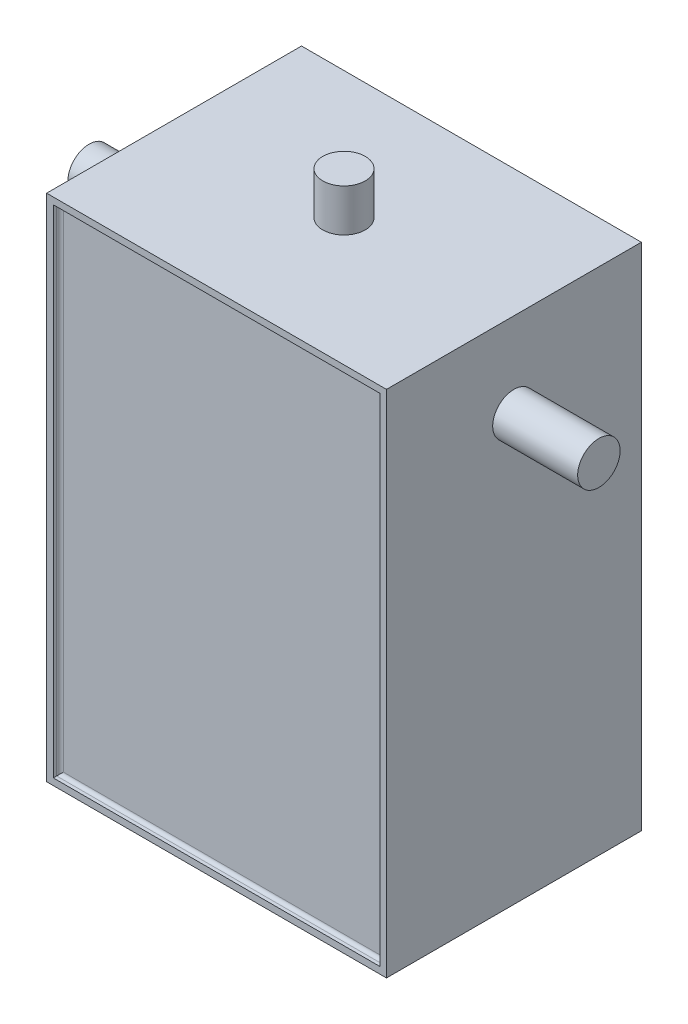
from build123d import *

# Parameters (mm, degrees)
SKETCH1_W            = 101.6
SKETCH1_H            = 152.4
BOSS_EXTRUDE1_DEPTH  = 76.2
SKETCH2_R            = 6.35
BOSS_EXTRUDE2_DEPTH  = 25.4
LPATTERN1_COUNT      = 2
LPATTERN1_PITCH      = 127
SKETCH3_R            = 12.7
BOSS_EXTRUDE3_DEPTH  = 12.7
SKETCH4_W            = 97.6
SKETCH4_H            = 148.4
CUT_EXTRUDE1_DEPTH   = 2
FILLET1_R            = 1
FILLET1_OF_MIRROR1_R = 1
BOSS_EXTRUDE4_DEPTH  = 12.7


with BuildPart() as part:
    # Sketch1 → Boss-Extrude1 (new body)
    with BuildSketch(Plane.XY):
        with Locations((50.8, 76.2)):
            Rectangle(SKETCH1_W, SKETCH1_H)
    extrude(amount=-BOSS_EXTRUDE1_DEPTH)

    # Sketch2 → Boss-Extrude2 (add)
    with BuildSketch(Plane(origin=(101.6, 0, 0), x_dir=(0, 0, -1), z_dir=(1, 0, 0))):
        with Locations(Location((38.1, 127, 0), (0, 0, 90))):
            Circle(SKETCH2_R)
    boss_extrude2 = extrude(amount=BOSS_EXTRUDE2_DEPTH)

    # LPattern1: Boss-Extrude2 ×2
    with Locations(*[(-i * LPATTERN1_PITCH, 0, 0) for i in range(1, LPATTERN1_COUNT)]):
        add(boss_extrude2)

    # Sketch3 → Boss-Extrude3 (add)
    with BuildSketch(Plane.XZ):
        with Locations(Location((50.8, -38.1, 0), (0, 0, 270))):
            Circle(SKETCH3_R)
    extrude(amount=BOSS_EXTRUDE3_DEPTH)

    # Sketch4 → Cut-Extrude1 (cut)
    with BuildSketch(Plane.XY):
        with Locations((50.8, 76.2)):
            Rectangle(SKETCH4_W, SKETCH4_H)
    cut_extrude1 = extrude(amount=-CUT_EXTRUDE1_DEPTH, mode=Mode.SUBTRACT)

    # Fillet1
    fillet1_edges = [part.edges().sort_by_distance(p)[0] for p in [
        (50.8, 150.4, -2),
        (99.6, 76.2, -2),
        (50.8, 2, -2),
        (2, 76.2, -2),
    ]]
    fillet(fillet1_edges, radius=FILLET1_R)

    # Mirror1: Cut-Extrude1 across plane
    add(cut_extrude1.mirror(Plane.XY.offset(-38.1)), mode=Mode.SUBTRACT)

    # Fillet1 of Mirror1
    fillet1_of_mirror1_edges = [part.edges().sort_by_distance(p)[0] for p in [
        (50.8, 150.4, -74.2),
        (99.6, 76.2, -74.2),
        (50.8, 2, -74.2),
        (2, 76.2, -74.2),
    ]]
    fillet(fillet1_of_mirror1_edges, radius=FILLET1_OF_MIRROR1_R)

    # Sketch5 → Boss-Extrude4 (add)
    with BuildSketch(Plane(origin=(0, 152.4, 0), x_dir=(1, 0, 0), z_dir=(0, 1, 0))):
        with BuildLine():
            ThreePointArc((57.15, 38.1), (55.290128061, 42.590128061), (50.8, 44.45))
            Line((50.8, 44.45), (50.8, 31.75))
            ThreePointArc((50.8, 31.75), (55.290128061, 33.609871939), (57.15, 38.1))
        make_face()
        with BuildLine():
            Line((50.8, 31.75), (50.8, 44.45))
            ThreePointArc((50.8, 44.45), (44.45, 38.1), (50.8, 31.75))
        make_face()
        with BuildLine():
            ThreePointArc((57.15, 38.1), (55.290128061, 42.590128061), (50.8, 44.45))
            Line((50.8, 44.45), (50.8, 31.75))
            ThreePointArc((50.8, 31.75), (55.290128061, 33.609871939), (57.15, 38.1))
        make_face()
        with BuildLine():
            Line((50.8, 31.75), (50.8, 44.45))
            ThreePointArc((50.8, 44.45), (44.45, 38.1), (50.8, 31.75))
        make_face()
    extrude(amount=BOSS_EXTRUDE4_DEPTH)


solid = part.part
